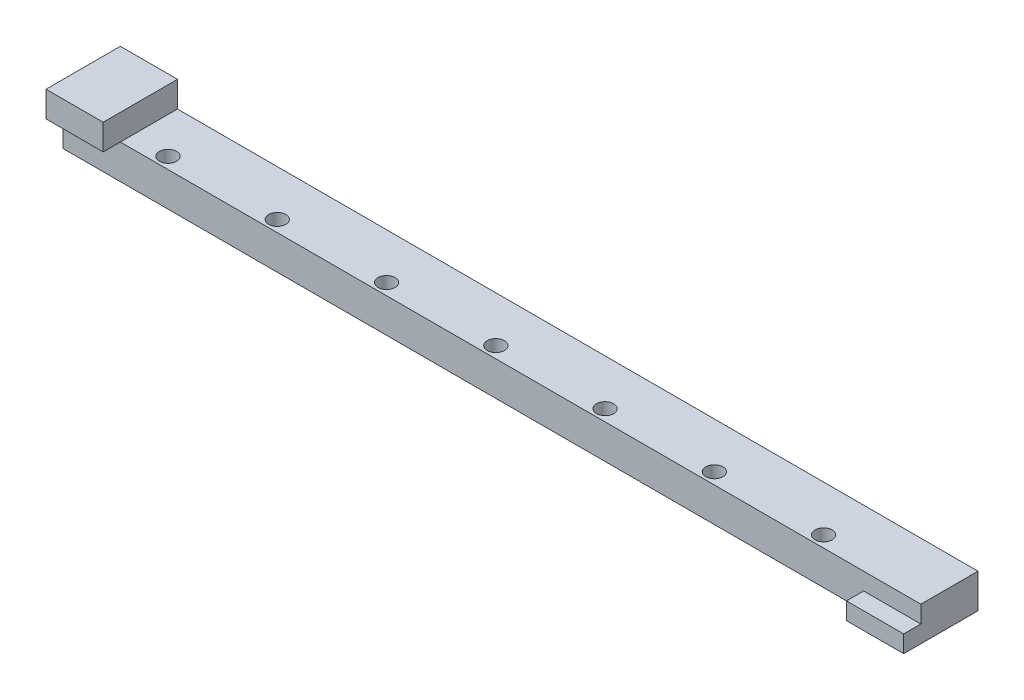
from build123d import *

# Parameters (mm, degrees)
SKETCH1_W           = 150
SKETCH1_H           = 10
BOSS_EXTRUDE1_DEPTH = 6
SKETCH2_W           = 10
SKETCH2_H           = 3
BOSS_EXTRUDE2_DEPTH = 3
SKETCH3_R           = 1.5
CUT_EXTRUDE1_DEPTH  = 151.452650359
ESQUISSE1_W         = 10
ESQUISSE1_H         = 10
BOSS_EXTRU_1_DEPTH  = 4.5
ESQUISSE2_W         = 10
ESQUISSE2_H         = 4.5
BOSS_EXTRU_2_DEPTH  = 3


with BuildPart() as part:
    # Sketch1 → Boss-Extrude1 (new body)
    with BuildSketch(Plane(origin=(0, 0, 0), x_dir=(1, 0, 0), z_dir=(0, 1, 0))):
        with Locations((75, 5)):
            Rectangle(SKETCH1_W, SKETCH1_H)
    extrude(amount=BOSS_EXTRUDE1_DEPTH)

    # Sketch2 → Boss-Extrude2 (add)
    with BuildSketch(Plane.XY):
        with Locations((145, 1.5)):
            Rectangle(SKETCH2_W, SKETCH2_H)
    extrude(amount=BOSS_EXTRUDE2_DEPTH)

    # Sketch3 → Cut-Extrude1 (cut, through all)
    with BuildSketch(Plane(origin=(0, 6, 0), x_dir=(1, 0, 0), z_dir=(0, 1, 0))):
        with Locations(Location((131, 2, 0), (0, 0, 270))):
            Circle(SKETCH3_R)
        with Locations(Location((111.89, 2, 0), (0, 0, 270))):
            Circle(SKETCH3_R)
        with Locations(Location((92.78, 2, 0), (0, 0, 270))):
            Circle(SKETCH3_R)
        with Locations(Location((73.67, 2, 0), (0, 0, 270))):
            Circle(SKETCH3_R)
        with Locations(Location((16.34, 2, 0), (0, 0, 270))):
            Circle(SKETCH3_R)
        with Locations(Location((35.45, 2, 0), (0, 0, 270))):
            Circle(SKETCH3_R)
        with Locations(Location((54.56, 2, 0), (0, 0, 270))):
            Circle(SKETCH3_R)
    extrude(amount=-CUT_EXTRUDE1_DEPTH, mode=Mode.SUBTRACT)

    # Esquisse1 → Boss.-Extru.1 (add)
    with BuildSketch(Plane(origin=(0, 6, 0), x_dir=(1, 0, 0), z_dir=(0, 1, 0))):
        with Locations((5, 5)):
            Rectangle(ESQUISSE1_W, ESQUISSE1_H)
    extrude(amount=BOSS_EXTRU_1_DEPTH)

    # Esquisse2 → Boss.-Extru.2 (add)
    with BuildSketch(Plane.XY):
        with Locations((5, 8.25)):
            Rectangle(ESQUISSE2_W, ESQUISSE2_H)
    extrude(amount=BOSS_EXTRU_2_DEPTH)


solid = part.part
